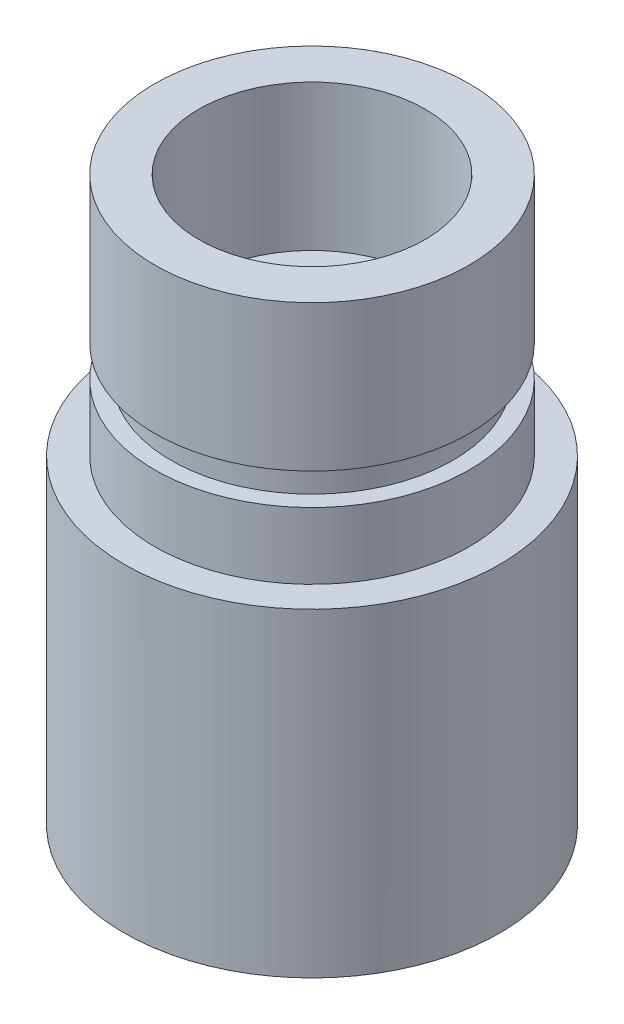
ISO-10303-21;
HEADER;
FILE_DESCRIPTION(('STEP AP214'),'2;1');
FILE_NAME('part.step','',(''),(''),'','','');
FILE_SCHEMA(('AUTOMOTIVE_DESIGN { 1 0 10303 214 1 1 1 1 }'));
ENDSEC;
DATA;
#1=APPLICATION_CONTEXT('core data for automotive mechanical design processes');
#2=APPLICATION_PROTOCOL_DEFINITION('international standard','automotive_design',2000,#1);
#3=PRODUCT_CONTEXT('',#1,'mechanical');
#4=PRODUCT('Part','Part','',(#3));
#5=PRODUCT_RELATED_PRODUCT_CATEGORY('part','',(#4));
#6=PRODUCT_DEFINITION_FORMATION('','',#4);
#7=PRODUCT_DEFINITION_CONTEXT('part definition',#1,'design');
#8=PRODUCT_DEFINITION('design','',#6,#7);
#9=PRODUCT_DEFINITION_SHAPE('','',#8);
#10=(LENGTH_UNIT() NAMED_UNIT(*) SI_UNIT(.MILLI.,.METRE.));
#11=(NAMED_UNIT(*) PLANE_ANGLE_UNIT() SI_UNIT($,.RADIAN.));
#12=(NAMED_UNIT(*) SI_UNIT($,.STERADIAN.) SOLID_ANGLE_UNIT());
#13=UNCERTAINTY_MEASURE_WITH_UNIT(LENGTH_MEASURE(1.E-05),#10,'distance_accuracy_value','');
#14=(GEOMETRIC_REPRESENTATION_CONTEXT(3) GLOBAL_UNCERTAINTY_ASSIGNED_CONTEXT((#13)) GLOBAL_UNIT_ASSIGNED_CONTEXT((#10,
#11,#12)) REPRESENTATION_CONTEXT('',''));
#15=CARTESIAN_POINT('',(0.,0.,0.));
#16=DIRECTION('',(0.,0.,1.));
#17=DIRECTION('',(1.,0.,0.));
#18=AXIS2_PLACEMENT_3D('',#15,#16,#17);
#19=CARTESIAN_POINT('',(0.,0.,0.));
#20=DIRECTION('',(0.,-1.,0.));
#21=DIRECTION('',(0.,0.,-1.));
#22=AXIS2_PLACEMENT_3D('',#19,#20,#21);
#23=CYLINDRICAL_SURFACE('',#22,7.3);
#24=CARTESIAN_POINT('',(0.,24.,0.));
#25=DIRECTION('',(0.,-1.,0.));
#26=DIRECTION('',(0.,0.,-1.));
#27=AXIS2_PLACEMENT_3D('',#24,#25,#26);
#28=CIRCLE('',#27,7.3);
#29=CARTESIAN_POINT('',(0.,24.,-7.3));
#30=VERTEX_POINT('',#29);
#31=EDGE_CURVE('E147',#30,#30,#28,.T.);
#32=ORIENTED_EDGE('',*,*,#31,.F.);
#33=EDGE_LOOP('',(#32));
#34=FACE_BOUND('',#33,.T.);
#35=CARTESIAN_POINT('',(-6.5733838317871,9.525,-3.175));
#36=CARTESIAN_POINT('',(-6.57336408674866,9.60968880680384,-3.17501341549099));
#37=CARTESIAN_POINT('',(-6.57501998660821,9.694366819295,-3.17161196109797));
#38=CARTESIAN_POINT('',(-6.58153518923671,9.8630227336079,-3.15808438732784));
#39=CARTESIAN_POINT('',(-6.58639304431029,9.94700093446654,-3.14796130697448));
#40=CARTESIAN_POINT('',(-6.59913570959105,10.1132804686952,-3.12115598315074));
#41=CARTESIAN_POINT('',(-6.60700676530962,10.1955876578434,-3.1045035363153));
#42=CARTESIAN_POINT('',(-6.62550018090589,10.3583206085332,-3.06483677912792));
#43=CARTESIAN_POINT('',(-6.63612275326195,10.4387462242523,-3.04182197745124));
#44=CARTESIAN_POINT('',(-6.67159618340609,10.6761728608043,-2.96363068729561));
#45=CARTESIAN_POINT('',(-6.70008464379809,10.8297076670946,-2.89924433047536));
#46=CARTESIAN_POINT('',(-6.76350779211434,11.1238800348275,-2.74802745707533));
#47=CARTESIAN_POINT('',(-6.79844986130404,11.2645025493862,-2.66117119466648));
#48=CARTESIAN_POINT('',(-6.8734496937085,11.5382828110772,-2.4612501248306));
#49=CARTESIAN_POINT('',(-6.91368953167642,11.6704608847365,-2.34690911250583));
#50=CARTESIAN_POINT('',(-6.99325625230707,11.9144747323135,-2.0979597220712));
#51=CARTESIAN_POINT('',(-7.03258292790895,12.0263059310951,-1.96334679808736));
#52=CARTESIAN_POINT('',(-7.10817052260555,12.2317099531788,-1.66971513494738));
#53=CARTESIAN_POINT('',(-7.14419296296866,12.3241456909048,-1.50983386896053));
#54=CARTESIAN_POINT('',(-7.20683477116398,12.4803740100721,-1.17493857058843));
#55=CARTESIAN_POINT('',(-7.23345869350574,12.5441804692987,-0.999931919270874));
#56=CARTESIAN_POINT('',(-7.27299771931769,12.637685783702,-0.650166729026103));
#57=CARTESIAN_POINT('',(-7.28659817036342,12.6690974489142,-0.475945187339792));
#58=CARTESIAN_POINT('',(-7.30106161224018,12.7024781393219,-0.124206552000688));
#59=CARTESIAN_POINT('',(-7.30193003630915,12.7044597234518,0.0533091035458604));
#60=CARTESIAN_POINT('',(-7.29121878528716,12.6797723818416,0.394056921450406));
#61=CARTESIAN_POINT('',(-7.28045939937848,12.654991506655,0.55745667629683));
#62=CARTESIAN_POINT('',(-7.24885181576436,12.5807489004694,0.877505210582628));
#63=CARTESIAN_POINT('',(-7.22800305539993,12.5312857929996,1.03415361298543));
#64=CARTESIAN_POINT('',(-7.17780818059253,12.4085272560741,1.3391581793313));
#65=CARTESIAN_POINT('',(-7.14833694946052,12.3348788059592,1.48735082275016));
#66=CARTESIAN_POINT('',(-7.08373401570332,12.1662076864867,1.76966561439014));
#67=CARTESIAN_POINT('',(-7.04860019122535,12.0711769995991,1.90378245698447));
#68=CARTESIAN_POINT('',(-6.97301019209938,11.8540779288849,2.16494476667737));
#69=CARTESIAN_POINT('',(-6.93235244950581,11.7305067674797,2.29068508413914));
#70=CARTESIAN_POINT('',(-6.85223286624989,11.4640429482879,2.52026156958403));
#71=CARTESIAN_POINT('',(-6.81277172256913,11.3211392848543,2.62408517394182));
#72=CARTESIAN_POINT('',(-6.73797222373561,11.0129410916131,2.81074295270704));
#73=CARTESIAN_POINT('',(-6.70285491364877,10.8469903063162,2.8925996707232));
#74=CARTESIAN_POINT('',(-6.65829294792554,10.5883623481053,2.99306919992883));
#75=CARTESIAN_POINT('',(-6.6447942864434,10.5005654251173,3.02283388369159));
#76=CARTESIAN_POINT('',(-6.6209743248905,10.322318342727,3.07465602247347));
#77=CARTESIAN_POINT('',(-6.61065161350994,10.2318693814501,3.09671690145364));
#78=CARTESIAN_POINT('',(-6.59272180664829,10.0394627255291,3.13473081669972));
#79=CARTESIAN_POINT('',(-6.58551254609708,9.93729211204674,3.14980175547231));
#80=CARTESIAN_POINT('',(-6.57582167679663,9.73175434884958,3.16995152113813));
#81=CARTESIAN_POINT('',(-6.57333997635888,9.62838722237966,3.17503054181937));
#82=CARTESIAN_POINT('',(-6.57338383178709,9.525,3.175));
#83=B_SPLINE_CURVE_WITH_KNOTS('',3,(#35,#36,#37,#38,#39,#40,#41,#42,#43,#44,#45,#46,#47,#48,#49,
#50,#51,#52,#53,#54,#55,#56,#57,#58,#59,#60,#61,#62,#63,#64,#65,#66,#67,#68,#69,#70,#71,#72,#73,
#74,#75,#76,#77,#78,#79,#80,#81,#82),.UNSPECIFIED.,.F.,.F.,(4,2,2,2,2,2,2,2,2,2,2,2,2,2,2,2,2,2,
2,2,2,2,2,4),(0.,0.25396408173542,0.507813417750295,0.760517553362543,1.01324120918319,
1.51753195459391,2.02240309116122,2.55809322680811,3.09390366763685,3.65548887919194,
4.21680157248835,4.74662075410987,5.27621383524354,5.77074653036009,6.26530680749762,
6.76743308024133,7.26974794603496,7.81011173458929,8.35078444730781,8.91256110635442,
9.19327156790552,9.47385710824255,9.78384017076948,10.0938172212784),.UNSPECIFIED.);
#84=CARTESIAN_POINT('',(-6.5733838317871,9.525,-3.175));
#85=VERTEX_POINT('',#84);
#86=CARTESIAN_POINT('',(-6.57338383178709,9.525,3.175));
#87=VERTEX_POINT('',#86);
#88=EDGE_CURVE('E98',#85,#87,#83,.T.);
#89=ORIENTED_EDGE('',*,*,#88,.F.);
#90=DIRECTION('',(0.,-1.,0.));
#91=VECTOR('',#90,1.);
#92=CARTESIAN_POINT('',(-6.5733838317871,0.,-3.175));
#93=LINE('',#92,#91);
#94=CARTESIAN_POINT('',(-6.5733838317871,0.,-3.175));
#95=VERTEX_POINT('',#94);
#96=EDGE_CURVE('E88',#95,#85,#93,.F.);
#97=ORIENTED_EDGE('',*,*,#96,.F.);
#98=CARTESIAN_POINT('',(0.,0.,0.));
#99=DIRECTION('',(0.,-1.,0.));
#100=DIRECTION('',(0.,0.,-1.));
#101=AXIS2_PLACEMENT_3D('',#98,#99,#100);
#102=CIRCLE('',#101,7.3);
#103=CARTESIAN_POINT('',(-6.57338383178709,0.,3.175));
#104=VERTEX_POINT('',#103);
#105=EDGE_CURVE('E13',#95,#104,#102,.T.);
#106=ORIENTED_EDGE('',*,*,#105,.T.);
#107=DIRECTION('',(0.,-1.,0.));
#108=VECTOR('',#107,1.);
#109=CARTESIAN_POINT('',(-6.5733838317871,0.,3.175));
#110=LINE('',#109,#108);
#111=EDGE_CURVE('E104',#87,#104,#110,.T.);
#112=ORIENTED_EDGE('',*,*,#111,.F.);
#113=EDGE_LOOP('',(#89,#97,#106,#112));
#114=FACE_BOUND('',#113,.T.);
#115=ADVANCED_FACE('F45',(#34,#114),#23,.F.);
#116=CARTESIAN_POINT('',(-7.3,0.,0.));
#117=DIRECTION('',(0.,1.,0.));
#118=DIRECTION('',(0.,0.,1.));
#119=AXIS2_PLACEMENT_3D('',#116,#117,#118);
#120=PLANE('',#119);
#121=ORIENTED_EDGE('',*,*,#105,.F.);
#122=DIRECTION('',(1.,0.,0.));
#123=VECTOR('',#122,1.);
#124=CARTESIAN_POINT('',(-12.701,0.,-3.175));
#125=LINE('',#124,#123);
#126=CARTESIAN_POINT('',(-12.2967221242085,0.,-3.175));
#127=VERTEX_POINT('',#126);
#128=EDGE_CURVE('E67',#127,#95,#125,.T.);
#129=ORIENTED_EDGE('',*,*,#128,.F.);
#130=CARTESIAN_POINT('',(0.,0.,0.));
#131=DIRECTION('',(0.,-1.,0.));
#132=DIRECTION('',(0.,0.,-1.));
#133=AXIS2_PLACEMENT_3D('',#130,#131,#132);
#134=CIRCLE('',#133,12.7);
#135=CARTESIAN_POINT('',(-12.2967221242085,0.,3.175));
#136=VERTEX_POINT('',#135);
#137=EDGE_CURVE('E52',#127,#136,#134,.T.);
#138=ORIENTED_EDGE('',*,*,#137,.T.);
#139=DIRECTION('',(1.,0.,0.));
#140=VECTOR('',#139,1.);
#141=CARTESIAN_POINT('',(-12.701,0.,3.175));
#142=LINE('',#141,#140);
#143=EDGE_CURVE('E111',#136,#104,#142,.T.);
#144=ORIENTED_EDGE('',*,*,#143,.T.);
#145=EDGE_LOOP('',(#121,#129,#138,#144));
#146=FACE_BOUND('',#145,.T.);
#147=ADVANCED_FACE('F138',(#146),#120,.F.);
#148=CARTESIAN_POINT('',(0.,0.,0.));
#149=DIRECTION('',(0.,-1.,0.));
#150=DIRECTION('',(0.,0.,-1.));
#151=AXIS2_PLACEMENT_3D('',#148,#149,#150);
#152=CYLINDRICAL_SURFACE('',#151,12.7);
#153=ORIENTED_EDGE('',*,*,#137,.F.);
#154=DIRECTION('',(0.,-1.,0.));
#155=VECTOR('',#154,1.);
#156=CARTESIAN_POINT('',(-12.2967221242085,0.,-3.175));
#157=LINE('',#156,#155);
#158=CARTESIAN_POINT('',(-12.2967221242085,9.525,-3.175));
#159=VERTEX_POINT('',#158);
#160=EDGE_CURVE('E87',#159,#127,#157,.T.);
#161=ORIENTED_EDGE('',*,*,#160,.F.);
#162=CARTESIAN_POINT('',(-12.2967221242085,9.525,3.175));
#163=CARTESIAN_POINT('',(-12.2967123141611,9.61280498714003,3.17501017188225));
#164=CARTESIAN_POINT('',(-12.2976623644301,9.70060394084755,3.1713577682));
#165=CARTESIAN_POINT('',(-12.3014094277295,9.87554530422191,3.15680681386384));
#166=CARTESIAN_POINT('',(-12.3042061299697,9.96268782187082,3.14590948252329));
#167=CARTESIAN_POINT('',(-12.3115665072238,10.1355309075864,3.11697623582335));
#168=CARTESIAN_POINT('',(-12.3161266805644,10.2212339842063,3.09895446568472));
#169=CARTESIAN_POINT('',(-12.3268698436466,10.3907447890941,3.05593970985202));
#170=CARTESIAN_POINT('',(-12.333052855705,10.47455249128,3.03094662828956));
#171=CARTESIAN_POINT('',(-12.3537772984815,10.7222418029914,2.94578467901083));
#172=CARTESIAN_POINT('',(-12.3705020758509,10.8825632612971,2.87540377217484));
#173=CARTESIAN_POINT('',(-12.4078731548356,11.1890884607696,2.70958690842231));
#174=CARTESIAN_POINT('',(-12.4285205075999,11.335288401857,2.61414423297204));
#175=CARTESIAN_POINT('',(-12.4719161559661,11.6126922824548,2.39866510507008));
#176=CARTESIAN_POINT('',(-12.4946978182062,11.7435442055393,2.27818133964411));
#177=CARTESIAN_POINT('',(-12.5395071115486,11.9834116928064,2.0170000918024));
#178=CARTESIAN_POINT('',(-12.5615346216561,12.0924237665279,1.87629938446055));
#179=CARTESIAN_POINT('',(-12.602723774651,12.2869667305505,1.57625079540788));
#180=CARTESIAN_POINT('',(-12.6218411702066,12.3721489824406,1.41667024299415));
#181=CARTESIAN_POINT('',(-12.6546719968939,12.5143412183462,1.08490568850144));
#182=CARTESIAN_POINT('',(-12.6683864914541,12.5713567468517,0.912724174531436));
#183=CARTESIAN_POINT('',(-12.688630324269,12.6544672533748,0.564337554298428));
#184=CARTESIAN_POINT('',(-12.695299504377,12.6811648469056,0.3882844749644));
#185=CARTESIAN_POINT('',(-12.7011886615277,12.7047732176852,0.0340765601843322));
#186=CARTESIAN_POINT('',(-12.7004095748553,12.7016877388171,-0.144078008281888));
#187=CARTESIAN_POINT('',(-12.6915937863,12.666249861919,-0.49324416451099));
#188=CARTESIAN_POINT('',(-12.6837185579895,12.6345485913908,-0.664326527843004));
#189=CARTESIAN_POINT('',(-12.6617834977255,12.5438259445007,-0.998660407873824));
#190=CARTESIAN_POINT('',(-12.6477233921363,12.4848033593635,-1.16191157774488));
#191=CARTESIAN_POINT('',(-12.6147511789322,12.3405859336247,-1.47766813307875));
#192=CARTESIAN_POINT('',(-12.5957963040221,12.2551590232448,-1.63006287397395));
#193=CARTESIAN_POINT('',(-12.5550912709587,12.0607355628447,-1.91857830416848));
#194=CARTESIAN_POINT('',(-12.5333406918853,11.9517354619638,-2.05469653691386));
#195=CARTESIAN_POINT('',(-12.4887217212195,11.7097844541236,-2.31066781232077));
#196=CARTESIAN_POINT('',(-12.4658390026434,11.5762670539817,-2.42998340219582));
#197=CARTESIAN_POINT('',(-12.4220658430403,11.2908401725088,-2.64467840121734));
#198=CARTESIAN_POINT('',(-12.4011759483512,11.138925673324,-2.74005125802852));
#199=CARTESIAN_POINT('',(-12.3636980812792,10.8199377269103,-2.90450495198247));
#200=CARTESIAN_POINT('',(-12.3471338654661,10.6527870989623,-2.97344153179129));
#201=CARTESIAN_POINT('',(-12.3204941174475,10.3088537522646,-3.08197996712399));
#202=CARTESIAN_POINT('',(-12.3104088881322,10.1320858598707,-3.1216256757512));
#203=CARTESIAN_POINT('',(-12.301705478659,9.88232281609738,-3.15564721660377));
#204=CARTESIAN_POINT('',(-12.2998396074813,9.81100494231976,-3.16290576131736));
#205=CARTESIAN_POINT('',(-12.2973484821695,9.66813601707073,-3.17257670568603));
#206=CARTESIAN_POINT('',(-12.2967212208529,9.59658553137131,-3.17499694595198));
#207=CARTESIAN_POINT('',(-12.2967221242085,9.525,-3.175));
#208=B_SPLINE_CURVE_WITH_KNOTS('',3,(#162,#163,#164,#165,#166,#167,#168,#169,#170,#171,#172,
#173,#174,#175,#176,#177,#178,#179,#180,#181,#182,#183,#184,#185,#186,#187,#188,#189,#190,#191,
#192,#193,#194,#195,#196,#197,#198,#199,#200,#201,#202,#203,#204,#205,#206,#207),.UNSPECIFIED.,
.F.,.F.,(4,2,2,2,2,2,2,2,2,2,2,2,2,2,2,2,2,2,2,2,2,2,4),(0.,0.263323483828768,0.526602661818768,
0.789361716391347,1.05212438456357,1.57712752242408,2.102271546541,2.63775727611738,
3.1733285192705,3.71636819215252,4.25930092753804,4.79124203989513,5.32311628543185,
5.84318507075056,6.36327686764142,6.88807642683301,7.412955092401,7.95198463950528,
8.49116154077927,9.03324011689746,9.57450546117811,9.78949744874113,10.0041407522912),.UNSPECIFIED.);
#209=CARTESIAN_POINT('',(-12.2967221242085,9.525,3.175));
#210=VERTEX_POINT('',#209);
#211=EDGE_CURVE('E95',#210,#159,#208,.T.);
#212=ORIENTED_EDGE('',*,*,#211,.F.);
#213=DIRECTION('',(0.,-1.,0.));
#214=VECTOR('',#213,1.);
#215=CARTESIAN_POINT('',(-12.2967221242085,0.,3.175));
#216=LINE('',#215,#214);
#217=EDGE_CURVE('E59',#136,#210,#216,.F.);
#218=ORIENTED_EDGE('',*,*,#217,.F.);
#219=EDGE_LOOP('',(#153,#161,#212,#218));
#220=FACE_BOUND('',#219,.T.);
#221=CARTESIAN_POINT('',(0.,21.6,0.));
#222=DIRECTION('',(0.,-1.,0.));
#223=DIRECTION('',(0.,0.,-1.));
#224=AXIS2_PLACEMENT_3D('',#221,#222,#223);
#225=CIRCLE('',#224,12.7);
#226=CARTESIAN_POINT('',(0.,21.6,-12.7));
#227=VERTEX_POINT('',#226);
#228=EDGE_CURVE('E182',#227,#227,#225,.T.);
#229=ORIENTED_EDGE('',*,*,#228,.T.);
#230=EDGE_LOOP('',(#229));
#231=FACE_BOUND('',#230,.T.);
#232=ADVANCED_FACE('F101',(#220,#231),#152,.T.);
#233=CARTESIAN_POINT('',(-12.7,21.6,0.));
#234=DIRECTION('',(0.,-1.,0.));
#235=DIRECTION('',(0.,0.,-1.));
#236=AXIS2_PLACEMENT_3D('',#233,#234,#235);
#237=PLANE('',#236);
#238=ORIENTED_EDGE('',*,*,#228,.F.);
#239=EDGE_LOOP('',(#238));
#240=FACE_BOUND('',#239,.T.);
#241=CARTESIAN_POINT('',(0.,21.6,0.));
#242=DIRECTION('',(0.,-1.,0.));
#243=DIRECTION('',(0.,0.,-1.));
#244=AXIS2_PLACEMENT_3D('',#241,#242,#243);
#245=CIRCLE('',#244,10.635);
#246=CARTESIAN_POINT('',(0.,21.6,-10.635));
#247=VERTEX_POINT('',#246);
#248=EDGE_CURVE('E179',#247,#247,#245,.T.);
#249=ORIENTED_EDGE('',*,*,#248,.T.);
#250=EDGE_LOOP('',(#249));
#251=FACE_BOUND('',#250,.T.);
#252=ADVANCED_FACE('F186',(#240,#251),#237,.F.);
#253=CARTESIAN_POINT('',(0.,0.,0.));
#254=DIRECTION('',(0.,-1.,0.));
#255=DIRECTION('',(0.,0.,-1.));
#256=AXIS2_PLACEMENT_3D('',#253,#254,#255);
#257=CYLINDRICAL_SURFACE('',#256,10.635);
#258=ORIENTED_EDGE('',*,*,#248,.F.);
#259=EDGE_LOOP('',(#258));
#260=FACE_BOUND('',#259,.T.);
#261=CARTESIAN_POINT('',(0.,26.1,0.));
#262=DIRECTION('',(0.,-1.,0.));
#263=DIRECTION('',(0.,0.,-1.));
#264=AXIS2_PLACEMENT_3D('',#261,#262,#263);
#265=CIRCLE('',#264,10.635);
#266=CARTESIAN_POINT('',(0.,26.1,-10.635));
#267=VERTEX_POINT('',#266);
#268=EDGE_CURVE('E176',#267,#267,#265,.T.);
#269=ORIENTED_EDGE('',*,*,#268,.T.);
#270=EDGE_LOOP('',(#269));
#271=FACE_BOUND('',#270,.T.);
#272=ADVANCED_FACE('F189',(#260,#271),#257,.T.);
#273=CARTESIAN_POINT('',(-10.635,26.1,0.));
#274=DIRECTION('',(0.,-1.,0.));
#275=DIRECTION('',(0.,0.,-1.));
#276=AXIS2_PLACEMENT_3D('',#273,#274,#275);
#277=PLANE('',#276);
#278=ORIENTED_EDGE('',*,*,#268,.F.);
#279=EDGE_LOOP('',(#278));
#280=FACE_BOUND('',#279,.T.);
#281=CARTESIAN_POINT('',(0.,26.1,0.));
#282=DIRECTION('',(0.,-1.,0.));
#283=DIRECTION('',(0.,0.,-1.));
#284=AXIS2_PLACEMENT_3D('',#281,#282,#283);
#285=CIRCLE('',#284,9.525);
#286=CARTESIAN_POINT('',(0.,26.1,-9.525));
#287=VERTEX_POINT('',#286);
#288=EDGE_CURVE('E173',#287,#287,#285,.T.);
#289=ORIENTED_EDGE('',*,*,#288,.T.);
#290=EDGE_LOOP('',(#289));
#291=FACE_BOUND('',#290,.T.);
#292=ADVANCED_FACE('F195',(#280,#291),#277,.F.);
#293=CARTESIAN_POINT('',(0.,0.,0.));
#294=DIRECTION('',(0.,-1.,0.));
#295=DIRECTION('',(0.,0.,-1.));
#296=AXIS2_PLACEMENT_3D('',#293,#294,#295);
#297=CYLINDRICAL_SURFACE('',#296,9.525);
#298=ORIENTED_EDGE('',*,*,#288,.F.);
#299=EDGE_LOOP('',(#298));
#300=FACE_BOUND('',#299,.T.);
#301=CARTESIAN_POINT('',(0.,28.2336,0.));
#302=DIRECTION('',(0.,-1.,0.));
#303=DIRECTION('',(0.,0.,-1.));
#304=AXIS2_PLACEMENT_3D('',#301,#302,#303);
#305=CIRCLE('',#304,9.525);
#306=CARTESIAN_POINT('',(0.,28.2336,-9.525));
#307=VERTEX_POINT('',#306);
#308=EDGE_CURVE('E170',#307,#307,#305,.T.);
#309=ORIENTED_EDGE('',*,*,#308,.T.);
#310=EDGE_LOOP('',(#309));
#311=FACE_BOUND('',#310,.T.);
#312=ADVANCED_FACE('F201',(#300,#311),#297,.T.);
#313=CARTESIAN_POINT('',(-10.635,28.2336,0.));
#314=DIRECTION('',(0.,1.,0.));
#315=DIRECTION('',(0.,0.,1.));
#316=AXIS2_PLACEMENT_3D('',#313,#314,#315);
#317=PLANE('',#316);
#318=ORIENTED_EDGE('',*,*,#308,.F.);
#319=EDGE_LOOP('',(#318));
#320=FACE_BOUND('',#319,.T.);
#321=CARTESIAN_POINT('',(0.,28.2336,0.));
#322=DIRECTION('',(0.,-1.,0.));
#323=DIRECTION('',(0.,0.,-1.));
#324=AXIS2_PLACEMENT_3D('',#321,#322,#323);
#325=CIRCLE('',#324,10.635);
#326=CARTESIAN_POINT('',(0.,28.2336,-10.635));
#327=VERTEX_POINT('',#326);
#328=EDGE_CURVE('E167',#327,#327,#325,.T.);
#329=ORIENTED_EDGE('',*,*,#328,.T.);
#330=EDGE_LOOP('',(#329));
#331=FACE_BOUND('',#330,.T.);
#332=ADVANCED_FACE('F207',(#320,#331),#317,.F.);
#333=CARTESIAN_POINT('',(0.,0.,0.));
#334=DIRECTION('',(0.,-1.,0.));
#335=DIRECTION('',(0.,0.,-1.));
#336=AXIS2_PLACEMENT_3D('',#333,#334,#335);
#337=CYLINDRICAL_SURFACE('',#336,10.635);
#338=ORIENTED_EDGE('',*,*,#328,.F.);
#339=EDGE_LOOP('',(#338));
#340=FACE_BOUND('',#339,.T.);
#341=CARTESIAN_POINT('',(0.,38.1,0.));
#342=DIRECTION('',(0.,-1.,0.));
#343=DIRECTION('',(0.,0.,-1.));
#344=AXIS2_PLACEMENT_3D('',#341,#342,#343);
#345=CIRCLE('',#344,10.635);
#346=CARTESIAN_POINT('',(0.,38.1,-10.635));
#347=VERTEX_POINT('',#346);
#348=EDGE_CURVE('E164',#347,#347,#345,.T.);
#349=ORIENTED_EDGE('',*,*,#348,.T.);
#350=EDGE_LOOP('',(#349));
#351=FACE_BOUND('',#350,.T.);
#352=ADVANCED_FACE('F213',(#340,#351),#337,.T.);
#353=CARTESIAN_POINT('',(-10.635,38.1,0.));
#354=DIRECTION('',(0.,-1.,0.));
#355=DIRECTION('',(0.,0.,-1.));
#356=AXIS2_PLACEMENT_3D('',#353,#354,#355);
#357=PLANE('',#356);
#358=ORIENTED_EDGE('',*,*,#348,.F.);
#359=EDGE_LOOP('',(#358));
#360=FACE_BOUND('',#359,.T.);
#361=CARTESIAN_POINT('',(0.,38.1,0.));
#362=DIRECTION('',(0.,-1.,0.));
#363=DIRECTION('',(0.,0.,-1.));
#364=AXIS2_PLACEMENT_3D('',#361,#362,#363);
#365=CIRCLE('',#364,7.65);
#366=CARTESIAN_POINT('',(0.,38.1,-7.65));
#367=VERTEX_POINT('',#366);
#368=EDGE_CURVE('E161',#367,#367,#365,.T.);
#369=ORIENTED_EDGE('',*,*,#368,.T.);
#370=EDGE_LOOP('',(#369));
#371=FACE_BOUND('',#370,.T.);
#372=ADVANCED_FACE('F219',(#360,#371),#357,.F.);
#373=CARTESIAN_POINT('',(0.,0.,0.));
#374=DIRECTION('',(0.,-1.,0.));
#375=DIRECTION('',(0.,0.,-1.));
#376=AXIS2_PLACEMENT_3D('',#373,#374,#375);
#377=CYLINDRICAL_SURFACE('',#376,7.65);
#378=ORIENTED_EDGE('',*,*,#368,.F.);
#379=EDGE_LOOP('',(#378));
#380=FACE_BOUND('',#379,.T.);
#381=CARTESIAN_POINT('',(0.,28.2336,0.));
#382=DIRECTION('',(0.,-1.,0.));
#383=DIRECTION('',(0.,0.,-1.));
#384=AXIS2_PLACEMENT_3D('',#381,#382,#383);
#385=CIRCLE('',#384,7.65);
#386=CARTESIAN_POINT('',(0.,28.2336,-7.65));
#387=VERTEX_POINT('',#386);
#388=EDGE_CURVE('E158',#387,#387,#385,.T.);
#389=ORIENTED_EDGE('',*,*,#388,.T.);
#390=EDGE_LOOP('',(#389));
#391=FACE_BOUND('',#390,.T.);
#392=ADVANCED_FACE('F225',(#380,#391),#377,.F.);
#393=CARTESIAN_POINT('',(-7.65,28.2336,0.));
#394=DIRECTION('',(0.,-1.,0.));
#395=DIRECTION('',(0.,0.,-1.));
#396=AXIS2_PLACEMENT_3D('',#393,#394,#395);
#397=PLANE('',#396);
#398=ORIENTED_EDGE('',*,*,#388,.F.);
#399=EDGE_LOOP('',(#398));
#400=FACE_BOUND('',#399,.T.);
#401=CARTESIAN_POINT('',(0.,28.2336,0.));
#402=DIRECTION('',(0.,-1.,0.));
#403=DIRECTION('',(0.,0.,-1.));
#404=AXIS2_PLACEMENT_3D('',#401,#402,#403);
#405=CIRCLE('',#404,2.);
#406=CARTESIAN_POINT('',(0.,28.2336,-2.));
#407=VERTEX_POINT('',#406);
#408=EDGE_CURVE('E153',#407,#407,#405,.T.);
#409=ORIENTED_EDGE('',*,*,#408,.T.);
#410=EDGE_LOOP('',(#409));
#411=FACE_BOUND('',#410,.T.);
#412=ADVANCED_FACE('F231',(#400,#411),#397,.F.);
#413=CARTESIAN_POINT('',(0.,0.,0.));
#414=DIRECTION('',(0.,-1.,0.));
#415=DIRECTION('',(0.,0.,-1.));
#416=AXIS2_PLACEMENT_3D('',#413,#414,#415);
#417=CYLINDRICAL_SURFACE('',#416,2.);
#418=ORIENTED_EDGE('',*,*,#408,.F.);
#419=EDGE_LOOP('',(#418));
#420=FACE_BOUND('',#419,.T.);
#421=CARTESIAN_POINT('',(0.,24.,0.));
#422=DIRECTION('',(0.,-1.,0.));
#423=DIRECTION('',(0.,0.,-1.));
#424=AXIS2_PLACEMENT_3D('',#421,#422,#423);
#425=CIRCLE('',#424,2.);
#426=CARTESIAN_POINT('',(0.,24.,-2.));
#427=VERTEX_POINT('',#426);
#428=EDGE_CURVE('E150',#427,#427,#425,.T.);
#429=ORIENTED_EDGE('',*,*,#428,.T.);
#430=EDGE_LOOP('',(#429));
#431=FACE_BOUND('',#430,.T.);
#432=ADVANCED_FACE('F237',(#420,#431),#417,.F.);
#433=CARTESIAN_POINT('',(-2.,24.,0.));
#434=DIRECTION('',(0.,1.,0.));
#435=DIRECTION('',(0.,0.,1.));
#436=AXIS2_PLACEMENT_3D('',#433,#434,#435);
#437=PLANE('',#436);
#438=ORIENTED_EDGE('',*,*,#428,.F.);
#439=EDGE_LOOP('',(#438));
#440=FACE_BOUND('',#439,.T.);
#441=ORIENTED_EDGE('',*,*,#31,.T.);
#442=EDGE_LOOP('',(#441));
#443=FACE_BOUND('',#442,.T.);
#444=ADVANCED_FACE('F136',(#440,#443),#437,.F.);
#445=CARTESIAN_POINT('',(-12.701,0.,-3.175));
#446=DIRECTION('',(0.,0.,-1.));
#447=DIRECTION('',(0.,1.,0.));
#448=AXIS2_PLACEMENT_3D('',#445,#446,#447);
#449=PLANE('',#448);
#450=ORIENTED_EDGE('',*,*,#96,.T.);
#451=DIRECTION('',(1.,0.,0.));
#452=VECTOR('',#451,1.);
#453=CARTESIAN_POINT('',(-12.701,9.525,-3.175));
#454=LINE('',#453,#452);
#455=EDGE_CURVE('E83',#159,#85,#454,.T.);
#456=ORIENTED_EDGE('',*,*,#455,.F.);
#457=ORIENTED_EDGE('',*,*,#160,.T.);
#458=ORIENTED_EDGE('',*,*,#128,.T.);
#459=EDGE_LOOP('',(#450,#456,#457,#458));
#460=FACE_BOUND('',#459,.T.);
#461=ADVANCED_FACE('F85',(#460),#449,.F.);
#462=CARTESIAN_POINT('',(-12.701,0.,3.175));
#463=DIRECTION('',(0.,0.,1.));
#464=DIRECTION('',(0.,-1.,0.));
#465=AXIS2_PLACEMENT_3D('',#462,#463,#464);
#466=PLANE('',#465);
#467=ORIENTED_EDGE('',*,*,#111,.T.);
#468=ORIENTED_EDGE('',*,*,#143,.F.);
#469=ORIENTED_EDGE('',*,*,#217,.T.);
#470=DIRECTION('',(1.,0.,0.));
#471=VECTOR('',#470,1.);
#472=CARTESIAN_POINT('',(-12.701,9.525,3.175));
#473=LINE('',#472,#471);
#474=EDGE_CURVE('E92',#210,#87,#473,.T.);
#475=ORIENTED_EDGE('',*,*,#474,.T.);
#476=EDGE_LOOP('',(#467,#468,#469,#475));
#477=FACE_BOUND('',#476,.T.);
#478=ADVANCED_FACE('F130',(#477),#466,.F.);
#479=CARTESIAN_POINT('',(-12.701,9.525,0.));
#480=DIRECTION('',(1.,0.,0.));
#481=DIRECTION('',(0.,0.,-1.));
#482=AXIS2_PLACEMENT_3D('',#479,#480,#481);
#483=CYLINDRICAL_SURFACE('',#482,3.175);
#484=ORIENTED_EDGE('',*,*,#88,.T.);
#485=ORIENTED_EDGE('',*,*,#474,.F.);
#486=ORIENTED_EDGE('',*,*,#211,.T.);
#487=ORIENTED_EDGE('',*,*,#455,.T.);
#488=EDGE_LOOP('',(#484,#485,#486,#487));
#489=FACE_BOUND('',#488,.T.);
#490=ADVANCED_FACE('F96',(#489),#483,.F.);
#491=CLOSED_SHELL('',(#115,#147,#232,#252,#272,#292,#312,#332,#352,#372,#392,#412,#432,#444,
#461,#478,#490));
#492=MANIFOLD_SOLID_BREP('B2',#491);
#493=ADVANCED_BREP_SHAPE_REPRESENTATION('',(#18,#492),#14);
#494=SHAPE_DEFINITION_REPRESENTATION(#9,#493);
ENDSEC;
END-ISO-10303-21;
